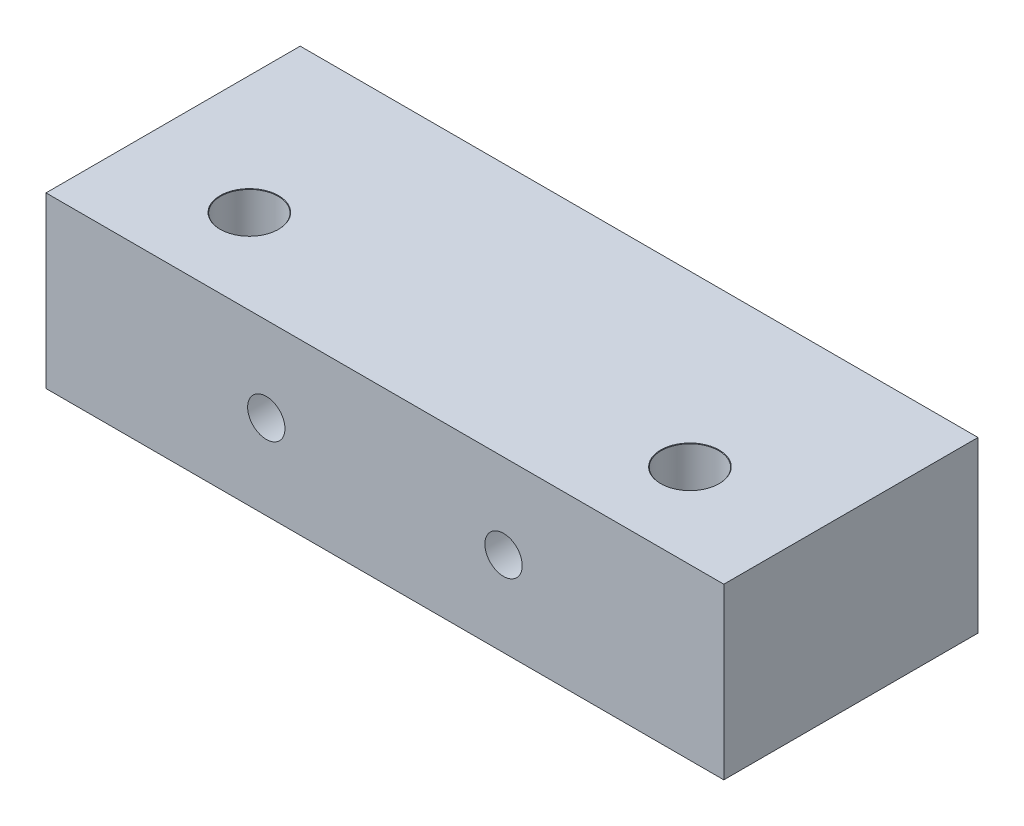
ISO-10303-21;
HEADER;
FILE_DESCRIPTION(('STEP AP214'),'2;1');
FILE_NAME('part.step','',(''),(''),'','','');
FILE_SCHEMA(('AUTOMOTIVE_DESIGN { 1 0 10303 214 1 1 1 1 }'));
ENDSEC;
DATA;
#1=APPLICATION_CONTEXT('core data for automotive mechanical design processes');
#2=APPLICATION_PROTOCOL_DEFINITION('international standard','automotive_design',2000,#1);
#3=PRODUCT_CONTEXT('',#1,'mechanical');
#4=PRODUCT('Part','Part','',(#3));
#5=PRODUCT_RELATED_PRODUCT_CATEGORY('part','',(#4));
#6=PRODUCT_DEFINITION_FORMATION('','',#4);
#7=PRODUCT_DEFINITION_CONTEXT('part definition',#1,'design');
#8=PRODUCT_DEFINITION('design','',#6,#7);
#9=PRODUCT_DEFINITION_SHAPE('','',#8);
#10=(LENGTH_UNIT() NAMED_UNIT(*) SI_UNIT(.MILLI.,.METRE.));
#11=(NAMED_UNIT(*) PLANE_ANGLE_UNIT() SI_UNIT($,.RADIAN.));
#12=(NAMED_UNIT(*) SI_UNIT($,.STERADIAN.) SOLID_ANGLE_UNIT());
#13=UNCERTAINTY_MEASURE_WITH_UNIT(LENGTH_MEASURE(1.E-05),#10,'distance_accuracy_value','');
#14=(GEOMETRIC_REPRESENTATION_CONTEXT(3) GLOBAL_UNCERTAINTY_ASSIGNED_CONTEXT((#13)) GLOBAL_UNIT_ASSIGNED_CONTEXT((#10,
#11,#12)) REPRESENTATION_CONTEXT('',''));
#15=CARTESIAN_POINT('',(0.,0.,0.));
#16=DIRECTION('',(0.,0.,1.));
#17=DIRECTION('',(1.,0.,0.));
#18=AXIS2_PLACEMENT_3D('',#15,#16,#17);
#19=CARTESIAN_POINT('',(69.3601743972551,-27.431998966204,15.));
#20=DIRECTION('',(-1.,0.,0.));
#21=DIRECTION('',(0.,0.,1.));
#22=AXIS2_PLACEMENT_3D('',#19,#20,#21);
#23=PLANE('',#22);
#24=DIRECTION('',(0.,1.,0.));
#25=VECTOR('',#24,1.);
#26=CARTESIAN_POINT('',(69.3601743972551,-27.431998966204,0.));
#27=LINE('',#26,#25);
#28=CARTESIAN_POINT('',(69.3601743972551,-37.431998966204,0.));
#29=VERTEX_POINT('',#28);
#30=CARTESIAN_POINT('',(69.3601743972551,-27.431998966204,0.));
#31=VERTEX_POINT('',#30);
#32=EDGE_CURVE('E82',#29,#31,#27,.T.);
#33=ORIENTED_EDGE('',*,*,#32,.T.);
#34=DIRECTION('',(0.,0.,-1.));
#35=VECTOR('',#34,1.);
#36=CARTESIAN_POINT('',(69.3601743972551,-27.431998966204,15.));
#37=LINE('',#36,#35);
#38=CARTESIAN_POINT('',(69.3601743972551,-27.431998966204,15.));
#39=VERTEX_POINT('',#38);
#40=EDGE_CURVE('E11',#39,#31,#37,.T.);
#41=ORIENTED_EDGE('',*,*,#40,.F.);
#42=DIRECTION('',(0.,1.,0.));
#43=VECTOR('',#42,1.);
#44=CARTESIAN_POINT('',(69.3601743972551,-27.431998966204,15.));
#45=LINE('',#44,#43);
#46=CARTESIAN_POINT('',(69.3601743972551,-37.431998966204,15.));
#47=VERTEX_POINT('',#46);
#48=EDGE_CURVE('E69',#47,#39,#45,.T.);
#49=ORIENTED_EDGE('',*,*,#48,.F.);
#50=DIRECTION('',(0.,0.,-1.));
#51=VECTOR('',#50,1.);
#52=CARTESIAN_POINT('',(69.3601743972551,-37.431998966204,15.));
#53=LINE('',#52,#51);
#54=EDGE_CURVE('E78',#47,#29,#53,.T.);
#55=ORIENTED_EDGE('',*,*,#54,.T.);
#56=EDGE_LOOP('',(#33,#41,#49,#55));
#57=FACE_BOUND('',#56,.T.);
#58=ADVANCED_FACE('F16',(#57),#23,.F.);
#59=CARTESIAN_POINT('',(69.3601743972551,-27.431998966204,15.));
#60=DIRECTION('',(0.,-1.,0.));
#61=DIRECTION('',(1.,0.,0.));
#62=AXIS2_PLACEMENT_3D('',#59,#60,#61);
#63=PLANE('',#62);
#64=CARTESIAN_POINT('',(62.3601743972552,-27.431998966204,10.));
#65=DIRECTION('',(0.,-1.,0.));
#66=DIRECTION('',(0.,0.,-1.));
#67=AXIS2_PLACEMENT_3D('',#64,#65,#66);
#68=CIRCLE('',#67,1.725);
#69=CARTESIAN_POINT('',(62.3601743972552,-27.431998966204,8.275));
#70=VERTEX_POINT('',#69);
#71=EDGE_CURVE('E147',#70,#70,#68,.T.);
#72=ORIENTED_EDGE('',*,*,#71,.T.);
#73=EDGE_LOOP('',(#72));
#74=FACE_BOUND('',#73,.T.);
#75=CARTESIAN_POINT('',(36.3601743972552,-27.431998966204,10.));
#76=DIRECTION('',(0.,-1.,0.));
#77=DIRECTION('',(0.,0.,-1.));
#78=AXIS2_PLACEMENT_3D('',#75,#76,#77);
#79=CIRCLE('',#78,1.725);
#80=CARTESIAN_POINT('',(36.3601743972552,-27.431998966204,8.275));
#81=VERTEX_POINT('',#80);
#82=EDGE_CURVE('E126',#81,#81,#79,.T.);
#83=ORIENTED_EDGE('',*,*,#82,.T.);
#84=EDGE_LOOP('',(#83));
#85=FACE_BOUND('',#84,.T.);
#86=DIRECTION('',(-1.,0.,0.));
#87=VECTOR('',#86,1.);
#88=CARTESIAN_POINT('',(69.3601743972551,-27.431998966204,0.));
#89=LINE('',#88,#87);
#90=CARTESIAN_POINT('',(29.3601743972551,-27.431998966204,0.));
#91=VERTEX_POINT('',#90);
#92=EDGE_CURVE('E73',#31,#91,#89,.T.);
#93=ORIENTED_EDGE('',*,*,#92,.T.);
#94=DIRECTION('',(0.,0.,-1.));
#95=VECTOR('',#94,1.);
#96=CARTESIAN_POINT('',(29.3601743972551,-27.431998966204,15.));
#97=LINE('',#96,#95);
#98=CARTESIAN_POINT('',(29.3601743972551,-27.431998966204,15.));
#99=VERTEX_POINT('',#98);
#100=EDGE_CURVE('E25',#99,#91,#97,.T.);
#101=ORIENTED_EDGE('',*,*,#100,.F.);
#102=DIRECTION('',(-1.,0.,0.));
#103=VECTOR('',#102,1.);
#104=CARTESIAN_POINT('',(69.3601743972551,-27.431998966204,15.));
#105=LINE('',#104,#103);
#106=EDGE_CURVE('E64',#39,#99,#105,.T.);
#107=ORIENTED_EDGE('',*,*,#106,.F.);
#108=ORIENTED_EDGE('',*,*,#40,.T.);
#109=EDGE_LOOP('',(#93,#101,#107,#108));
#110=FACE_BOUND('',#109,.T.);
#111=ADVANCED_FACE('F72',(#74,#85,#110),#63,.F.);
#112=CARTESIAN_POINT('',(29.3601743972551,-27.431998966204,15.));
#113=DIRECTION('',(1.,0.,0.));
#114=DIRECTION('',(0.,0.,-1.));
#115=AXIS2_PLACEMENT_3D('',#112,#113,#114);
#116=PLANE('',#115);
#117=DIRECTION('',(0.,-1.,0.));
#118=VECTOR('',#117,1.);
#119=CARTESIAN_POINT('',(29.3601743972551,-27.431998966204,0.));
#120=LINE('',#119,#118);
#121=CARTESIAN_POINT('',(29.3601743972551,-37.431998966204,0.));
#122=VERTEX_POINT('',#121);
#123=EDGE_CURVE('E51',#91,#122,#120,.T.);
#124=ORIENTED_EDGE('',*,*,#123,.T.);
#125=DIRECTION('',(0.,0.,-1.));
#126=VECTOR('',#125,1.);
#127=CARTESIAN_POINT('',(29.3601743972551,-37.431998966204,15.));
#128=LINE('',#127,#126);
#129=CARTESIAN_POINT('',(29.3601743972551,-37.431998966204,15.));
#130=VERTEX_POINT('',#129);
#131=EDGE_CURVE('E74',#130,#122,#128,.T.);
#132=ORIENTED_EDGE('',*,*,#131,.F.);
#133=DIRECTION('',(0.,-1.,0.));
#134=VECTOR('',#133,1.);
#135=CARTESIAN_POINT('',(29.3601743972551,-27.431998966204,15.));
#136=LINE('',#135,#134);
#137=EDGE_CURVE('E67',#99,#130,#136,.T.);
#138=ORIENTED_EDGE('',*,*,#137,.F.);
#139=ORIENTED_EDGE('',*,*,#100,.T.);
#140=EDGE_LOOP('',(#124,#132,#138,#139));
#141=FACE_BOUND('',#140,.T.);
#142=ADVANCED_FACE('F76',(#141),#116,.F.);
#143=CARTESIAN_POINT('',(69.3601743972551,-37.431998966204,15.));
#144=DIRECTION('',(0.,1.,0.));
#145=DIRECTION('',(-1.,0.,0.));
#146=AXIS2_PLACEMENT_3D('',#143,#144,#145);
#147=PLANE('',#146);
#148=CARTESIAN_POINT('',(62.3601743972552,-37.431998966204,10.));
#149=DIRECTION('',(0.,-1.,0.));
#150=DIRECTION('',(0.,0.,-1.));
#151=AXIS2_PLACEMENT_3D('',#148,#149,#150);
#152=CIRCLE('',#151,3.025);
#153=CARTESIAN_POINT('',(62.3601743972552,-37.431998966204,6.975));
#154=VERTEX_POINT('',#153);
#155=EDGE_CURVE('E144',#154,#154,#152,.T.);
#156=ORIENTED_EDGE('',*,*,#155,.F.);
#157=EDGE_LOOP('',(#156));
#158=FACE_BOUND('',#157,.T.);
#159=CARTESIAN_POINT('',(36.3601743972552,-37.431998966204,10.));
#160=DIRECTION('',(0.,-1.,0.));
#161=DIRECTION('',(0.,0.,-1.));
#162=AXIS2_PLACEMENT_3D('',#159,#160,#161);
#163=CIRCLE('',#162,3.025);
#164=CARTESIAN_POINT('',(36.3601743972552,-37.431998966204,6.975));
#165=VERTEX_POINT('',#164);
#166=EDGE_CURVE('E123',#165,#165,#163,.T.);
#167=ORIENTED_EDGE('',*,*,#166,.F.);
#168=EDGE_LOOP('',(#167));
#169=FACE_BOUND('',#168,.T.);
#170=DIRECTION('',(1.,0.,0.));
#171=VECTOR('',#170,1.);
#172=CARTESIAN_POINT('',(69.3601743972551,-37.431998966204,0.));
#173=LINE('',#172,#171);
#174=EDGE_CURVE('E57',#122,#29,#173,.T.);
#175=ORIENTED_EDGE('',*,*,#174,.T.);
#176=ORIENTED_EDGE('',*,*,#54,.F.);
#177=DIRECTION('',(1.,0.,0.));
#178=VECTOR('',#177,1.);
#179=CARTESIAN_POINT('',(69.3601743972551,-37.431998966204,15.));
#180=LINE('',#179,#178);
#181=EDGE_CURVE('E34',#130,#47,#180,.T.);
#182=ORIENTED_EDGE('',*,*,#181,.F.);
#183=ORIENTED_EDGE('',*,*,#131,.T.);
#184=EDGE_LOOP('',(#175,#176,#182,#183));
#185=FACE_BOUND('',#184,.T.);
#186=ADVANCED_FACE('F190',(#158,#169,#185),#147,.F.);
#187=CARTESIAN_POINT('',(0.,0.,15.));
#188=DIRECTION('',(0.,0.,-1.));
#189=DIRECTION('',(-1.,0.,0.));
#190=AXIS2_PLACEMENT_3D('',#187,#188,#189);
#191=PLANE('',#190);
#192=CARTESIAN_POINT('',(42.3601743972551,-32.431998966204,15.));
#193=DIRECTION('',(0.,0.,-1.));
#194=DIRECTION('',(-1.,0.,0.));
#195=AXIS2_PLACEMENT_3D('',#192,#193,#194);
#196=CIRCLE('',#195,1.10143231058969);
#197=CARTESIAN_POINT('',(41.2587420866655,-32.431998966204,15.));
#198=VERTEX_POINT('',#197);
#199=EDGE_CURVE('E19',#198,#198,#196,.T.);
#200=ORIENTED_EDGE('',*,*,#199,.T.);
#201=EDGE_LOOP('',(#200));
#202=FACE_BOUND('',#201,.T.);
#203=CARTESIAN_POINT('',(56.3601743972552,-32.431998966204,15.));
#204=DIRECTION('',(0.,0.,-1.));
#205=DIRECTION('',(-1.,0.,0.));
#206=AXIS2_PLACEMENT_3D('',#203,#204,#205);
#207=CIRCLE('',#206,1.10143231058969);
#208=CARTESIAN_POINT('',(55.2587420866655,-32.431998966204,15.));
#209=VERTEX_POINT('',#208);
#210=EDGE_CURVE('E85',#209,#209,#207,.T.);
#211=ORIENTED_EDGE('',*,*,#210,.T.);
#212=EDGE_LOOP('',(#211));
#213=FACE_BOUND('',#212,.T.);
#214=ORIENTED_EDGE('',*,*,#48,.T.);
#215=ORIENTED_EDGE('',*,*,#106,.T.);
#216=ORIENTED_EDGE('',*,*,#137,.T.);
#217=ORIENTED_EDGE('',*,*,#181,.T.);
#218=EDGE_LOOP('',(#214,#215,#216,#217));
#219=FACE_BOUND('',#218,.T.);
#220=ADVANCED_FACE('F65',(#202,#213,#219),#191,.F.);
#221=CARTESIAN_POINT('',(0.,0.,0.));
#222=DIRECTION('',(0.,0.,-1.));
#223=DIRECTION('',(-1.,0.,0.));
#224=AXIS2_PLACEMENT_3D('',#221,#222,#223);
#225=PLANE('',#224);
#226=CARTESIAN_POINT('',(42.3601743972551,-32.431998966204,0.));
#227=DIRECTION('',(0.,0.,-1.));
#228=DIRECTION('',(-1.,0.,0.));
#229=AXIS2_PLACEMENT_3D('',#226,#227,#228);
#230=CIRCLE('',#229,2.1);
#231=CARTESIAN_POINT('',(40.2601743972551,-32.431998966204,0.));
#232=VERTEX_POINT('',#231);
#233=EDGE_CURVE('E105',#232,#232,#230,.T.);
#234=ORIENTED_EDGE('',*,*,#233,.F.);
#235=EDGE_LOOP('',(#234));
#236=FACE_BOUND('',#235,.T.);
#237=CARTESIAN_POINT('',(56.3601743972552,-32.431998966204,0.));
#238=DIRECTION('',(0.,0.,-1.));
#239=DIRECTION('',(-1.,0.,0.));
#240=AXIS2_PLACEMENT_3D('',#237,#238,#239);
#241=CIRCLE('',#240,2.1);
#242=CARTESIAN_POINT('',(54.2601743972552,-32.431998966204,0.));
#243=VERTEX_POINT('',#242);
#244=EDGE_CURVE('E95',#243,#243,#241,.T.);
#245=ORIENTED_EDGE('',*,*,#244,.F.);
#246=EDGE_LOOP('',(#245));
#247=FACE_BOUND('',#246,.T.);
#248=ORIENTED_EDGE('',*,*,#32,.F.);
#249=ORIENTED_EDGE('',*,*,#174,.F.);
#250=ORIENTED_EDGE('',*,*,#123,.F.);
#251=ORIENTED_EDGE('',*,*,#92,.F.);
#252=EDGE_LOOP('',(#248,#249,#250,#251));
#253=FACE_BOUND('',#252,.T.);
#254=ADVANCED_FACE('F217',(#236,#247,#253),#225,.T.);
#255=CARTESIAN_POINT('',(56.3601743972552,-32.431998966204,14.4));
#256=DIRECTION('',(0.,0.,-1.));
#257=DIRECTION('',(-1.,0.,0.));
#258=AXIS2_PLACEMENT_3D('',#255,#256,#257);
#259=CONICAL_SURFACE('',#258,2.1,1.02974425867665);
#260=CARTESIAN_POINT('',(56.3601743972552,-32.431998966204,14.4));
#261=DIRECTION('',(0.,0.,-1.));
#262=DIRECTION('',(-1.,0.,0.));
#263=AXIS2_PLACEMENT_3D('',#260,#261,#262);
#264=CIRCLE('',#263,2.1);
#265=CARTESIAN_POINT('',(54.2601743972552,-32.431998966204,14.4));
#266=VERTEX_POINT('',#265);
#267=EDGE_CURVE('E91',#266,#266,#264,.T.);
#268=ORIENTED_EDGE('',*,*,#267,.T.);
#269=EDGE_LOOP('',(#268));
#270=FACE_BOUND('',#269,.T.);
#271=ORIENTED_EDGE('',*,*,#210,.F.);
#272=EDGE_LOOP('',(#271));
#273=FACE_BOUND('',#272,.T.);
#274=ADVANCED_FACE('F219',(#270,#273),#259,.F.);
#275=CARTESIAN_POINT('',(56.3601743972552,-32.431998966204,0.));
#276=DIRECTION('',(0.,0.,-1.));
#277=DIRECTION('',(-1.,0.,0.));
#278=AXIS2_PLACEMENT_3D('',#275,#276,#277);
#279=CYLINDRICAL_SURFACE('',#278,2.1);
#280=ORIENTED_EDGE('',*,*,#267,.F.);
#281=EDGE_LOOP('',(#280));
#282=FACE_BOUND('',#281,.T.);
#283=ORIENTED_EDGE('',*,*,#244,.T.);
#284=EDGE_LOOP('',(#283));
#285=FACE_BOUND('',#284,.T.);
#286=ADVANCED_FACE('F227',(#282,#285),#279,.F.);
#287=CARTESIAN_POINT('',(42.3601743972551,-32.431998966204,14.4));
#288=DIRECTION('',(0.,0.,-1.));
#289=DIRECTION('',(-1.,0.,0.));
#290=AXIS2_PLACEMENT_3D('',#287,#288,#289);
#291=CONICAL_SURFACE('',#290,2.1,1.02974425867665);
#292=CARTESIAN_POINT('',(42.3601743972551,-32.431998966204,14.4));
#293=DIRECTION('',(0.,0.,-1.));
#294=DIRECTION('',(-1.,0.,0.));
#295=AXIS2_PLACEMENT_3D('',#292,#293,#294);
#296=CIRCLE('',#295,2.1);
#297=CARTESIAN_POINT('',(40.2601743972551,-32.431998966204,14.4));
#298=VERTEX_POINT('',#297);
#299=EDGE_CURVE('E102',#298,#298,#296,.T.);
#300=ORIENTED_EDGE('',*,*,#299,.T.);
#301=EDGE_LOOP('',(#300));
#302=FACE_BOUND('',#301,.T.);
#303=ORIENTED_EDGE('',*,*,#199,.F.);
#304=EDGE_LOOP('',(#303));
#305=FACE_BOUND('',#304,.T.);
#306=ADVANCED_FACE('F274',(#302,#305),#291,.F.);
#307=CARTESIAN_POINT('',(42.3601743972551,-32.431998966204,0.));
#308=DIRECTION('',(0.,0.,-1.));
#309=DIRECTION('',(-1.,0.,0.));
#310=AXIS2_PLACEMENT_3D('',#307,#308,#309);
#311=CYLINDRICAL_SURFACE('',#310,2.1);
#312=ORIENTED_EDGE('',*,*,#299,.F.);
#313=EDGE_LOOP('',(#312));
#314=FACE_BOUND('',#313,.T.);
#315=ORIENTED_EDGE('',*,*,#233,.T.);
#316=EDGE_LOOP('',(#315));
#317=FACE_BOUND('',#316,.T.);
#318=ADVANCED_FACE('F286',(#314,#317),#311,.F.);
#319=CARTESIAN_POINT('',(36.3601743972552,-27.456998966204,10.));
#320=DIRECTION('',(0.,1.,0.));
#321=DIRECTION('',(0.,0.,1.));
#322=AXIS2_PLACEMENT_3D('',#319,#320,#321);
#323=CONICAL_SURFACE('',#322,1.7,0.785398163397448);
#324=ORIENTED_EDGE('',*,*,#82,.F.);
#325=EDGE_LOOP('',(#324));
#326=FACE_BOUND('',#325,.T.);
#327=CARTESIAN_POINT('',(36.3601743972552,-27.456998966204,10.));
#328=DIRECTION('',(0.,-1.,0.));
#329=DIRECTION('',(0.,0.,-1.));
#330=AXIS2_PLACEMENT_3D('',#327,#328,#329);
#331=CIRCLE('',#330,1.7);
#332=CARTESIAN_POINT('',(36.3601743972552,-27.456998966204,8.3));
#333=VERTEX_POINT('',#332);
#334=EDGE_CURVE('E108',#333,#333,#331,.T.);
#335=ORIENTED_EDGE('',*,*,#334,.T.);
#336=EDGE_LOOP('',(#335));
#337=FACE_BOUND('',#336,.T.);
#338=ADVANCED_FACE('F295',(#326,#337),#323,.F.);
#339=CARTESIAN_POINT('',(36.3601743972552,-37.431998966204,10.));
#340=DIRECTION('',(0.,-1.,0.));
#341=DIRECTION('',(0.,0.,-1.));
#342=AXIS2_PLACEMENT_3D('',#339,#340,#341);
#343=CYLINDRICAL_SURFACE('',#342,1.7);
#344=ORIENTED_EDGE('',*,*,#334,.F.);
#345=EDGE_LOOP('',(#344));
#346=FACE_BOUND('',#345,.T.);
#347=CARTESIAN_POINT('',(36.3601743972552,-34.006998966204,10.));
#348=DIRECTION('',(0.,-1.,0.));
#349=DIRECTION('',(0.,0.,-1.));
#350=AXIS2_PLACEMENT_3D('',#347,#348,#349);
#351=CIRCLE('',#350,1.7);
#352=CARTESIAN_POINT('',(36.3601743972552,-34.006998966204,8.3));
#353=VERTEX_POINT('',#352);
#354=EDGE_CURVE('E111',#353,#353,#351,.T.);
#355=ORIENTED_EDGE('',*,*,#354,.T.);
#356=EDGE_LOOP('',(#355));
#357=FACE_BOUND('',#356,.T.);
#358=ADVANCED_FACE('F305',(#346,#357),#343,.F.);
#359=CARTESIAN_POINT('',(36.3601743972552,-34.031998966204,10.));
#360=DIRECTION('',(0.,-1.,0.));
#361=DIRECTION('',(0.,0.,-1.));
#362=AXIS2_PLACEMENT_3D('',#359,#360,#361);
#363=CONICAL_SURFACE('',#362,1.725,0.785398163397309);
#364=ORIENTED_EDGE('',*,*,#354,.F.);
#365=EDGE_LOOP('',(#364));
#366=FACE_BOUND('',#365,.T.);
#367=CARTESIAN_POINT('',(36.3601743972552,-34.031998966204,10.));
#368=DIRECTION('',(0.,-1.,0.));
#369=DIRECTION('',(0.,0.,-1.));
#370=AXIS2_PLACEMENT_3D('',#367,#368,#369);
#371=CIRCLE('',#370,1.725);
#372=CARTESIAN_POINT('',(36.3601743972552,-34.031998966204,8.275));
#373=VERTEX_POINT('',#372);
#374=EDGE_CURVE('E114',#373,#373,#371,.T.);
#375=ORIENTED_EDGE('',*,*,#374,.T.);
#376=EDGE_LOOP('',(#375));
#377=FACE_BOUND('',#376,.T.);
#378=ADVANCED_FACE('F315',(#366,#377),#363,.F.);
#379=CARTESIAN_POINT('',(38.0851743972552,-34.031998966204,10.));
#380=DIRECTION('',(0.,1.,0.));
#381=DIRECTION('',(0.,0.,1.));
#382=AXIS2_PLACEMENT_3D('',#379,#380,#381);
#383=PLANE('',#382);
#384=ORIENTED_EDGE('',*,*,#374,.F.);
#385=EDGE_LOOP('',(#384));
#386=FACE_BOUND('',#385,.T.);
#387=CARTESIAN_POINT('',(36.3601743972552,-34.031998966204,10.));
#388=DIRECTION('',(0.,-1.,0.));
#389=DIRECTION('',(0.,0.,-1.));
#390=AXIS2_PLACEMENT_3D('',#387,#388,#389);
#391=CIRCLE('',#390,3.);
#392=CARTESIAN_POINT('',(36.3601743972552,-34.031998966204,7.));
#393=VERTEX_POINT('',#392);
#394=EDGE_CURVE('E117',#393,#393,#391,.T.);
#395=ORIENTED_EDGE('',*,*,#394,.T.);
#396=EDGE_LOOP('',(#395));
#397=FACE_BOUND('',#396,.T.);
#398=ADVANCED_FACE('F205',(#386,#397),#383,.F.);
#399=CARTESIAN_POINT('',(36.3601743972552,-37.431998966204,10.));
#400=DIRECTION('',(0.,-1.,0.));
#401=DIRECTION('',(0.,0.,-1.));
#402=AXIS2_PLACEMENT_3D('',#399,#400,#401);
#403=CYLINDRICAL_SURFACE('',#402,3.);
#404=ORIENTED_EDGE('',*,*,#394,.F.);
#405=EDGE_LOOP('',(#404));
#406=FACE_BOUND('',#405,.T.);
#407=CARTESIAN_POINT('',(36.3601743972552,-37.406998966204,10.));
#408=DIRECTION('',(0.,-1.,0.));
#409=DIRECTION('',(0.,0.,-1.));
#410=AXIS2_PLACEMENT_3D('',#407,#408,#409);
#411=CIRCLE('',#410,3.);
#412=CARTESIAN_POINT('',(36.3601743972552,-37.406998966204,7.));
#413=VERTEX_POINT('',#412);
#414=EDGE_CURVE('E120',#413,#413,#411,.T.);
#415=ORIENTED_EDGE('',*,*,#414,.T.);
#416=EDGE_LOOP('',(#415));
#417=FACE_BOUND('',#416,.T.);
#418=ADVANCED_FACE('F197',(#406,#417),#403,.F.);
#419=CARTESIAN_POINT('',(36.3601743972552,-37.431998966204,10.));
#420=DIRECTION('',(0.,-1.,0.));
#421=DIRECTION('',(0.,0.,-1.));
#422=AXIS2_PLACEMENT_3D('',#419,#420,#421);
#423=CONICAL_SURFACE('',#422,3.025,0.785398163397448);
#424=ORIENTED_EDGE('',*,*,#414,.F.);
#425=EDGE_LOOP('',(#424));
#426=FACE_BOUND('',#425,.T.);
#427=ORIENTED_EDGE('',*,*,#166,.T.);
#428=EDGE_LOOP('',(#427));
#429=FACE_BOUND('',#428,.T.);
#430=ADVANCED_FACE('F157',(#426,#429),#423,.F.);
#431=CARTESIAN_POINT('',(62.3601743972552,-27.456998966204,10.));
#432=DIRECTION('',(0.,1.,0.));
#433=DIRECTION('',(0.,0.,1.));
#434=AXIS2_PLACEMENT_3D('',#431,#432,#433);
#435=CONICAL_SURFACE('',#434,1.7,0.785398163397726);
#436=ORIENTED_EDGE('',*,*,#71,.F.);
#437=EDGE_LOOP('',(#436));
#438=FACE_BOUND('',#437,.T.);
#439=CARTESIAN_POINT('',(62.3601743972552,-27.456998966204,10.));
#440=DIRECTION('',(0.,-1.,0.));
#441=DIRECTION('',(0.,0.,-1.));
#442=AXIS2_PLACEMENT_3D('',#439,#440,#441);
#443=CIRCLE('',#442,1.7);
#444=CARTESIAN_POINT('',(62.3601743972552,-27.456998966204,8.3));
#445=VERTEX_POINT('',#444);
#446=EDGE_CURVE('E129',#445,#445,#443,.T.);
#447=ORIENTED_EDGE('',*,*,#446,.T.);
#448=EDGE_LOOP('',(#447));
#449=FACE_BOUND('',#448,.T.);
#450=ADVANCED_FACE('F153',(#438,#449),#435,.F.);
#451=CARTESIAN_POINT('',(62.3601743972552,-37.431998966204,10.));
#452=DIRECTION('',(0.,-1.,0.));
#453=DIRECTION('',(0.,0.,-1.));
#454=AXIS2_PLACEMENT_3D('',#451,#452,#453);
#455=CYLINDRICAL_SURFACE('',#454,1.7);
#456=ORIENTED_EDGE('',*,*,#446,.F.);
#457=EDGE_LOOP('',(#456));
#458=FACE_BOUND('',#457,.T.);
#459=CARTESIAN_POINT('',(62.3601743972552,-34.006998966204,10.));
#460=DIRECTION('',(0.,-1.,0.));
#461=DIRECTION('',(0.,0.,-1.));
#462=AXIS2_PLACEMENT_3D('',#459,#460,#461);
#463=CIRCLE('',#462,1.7);
#464=CARTESIAN_POINT('',(62.3601743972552,-34.006998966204,8.3));
#465=VERTEX_POINT('',#464);
#466=EDGE_CURVE('E132',#465,#465,#463,.T.);
#467=ORIENTED_EDGE('',*,*,#466,.T.);
#468=EDGE_LOOP('',(#467));
#469=FACE_BOUND('',#468,.T.);
#470=ADVANCED_FACE('F156',(#458,#469),#455,.F.);
#471=CARTESIAN_POINT('',(62.3601743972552,-34.031998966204,10.));
#472=DIRECTION('',(0.,-1.,0.));
#473=DIRECTION('',(0.,0.,-1.));
#474=AXIS2_PLACEMENT_3D('',#471,#472,#473);
#475=CONICAL_SURFACE('',#474,1.725,0.785398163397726);
#476=ORIENTED_EDGE('',*,*,#466,.F.);
#477=EDGE_LOOP('',(#476));
#478=FACE_BOUND('',#477,.T.);
#479=CARTESIAN_POINT('',(62.3601743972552,-34.031998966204,10.));
#480=DIRECTION('',(0.,-1.,0.));
#481=DIRECTION('',(0.,0.,-1.));
#482=AXIS2_PLACEMENT_3D('',#479,#480,#481);
#483=CIRCLE('',#482,1.725);
#484=CARTESIAN_POINT('',(62.3601743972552,-34.031998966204,8.275));
#485=VERTEX_POINT('',#484);
#486=EDGE_CURVE('E135',#485,#485,#483,.T.);
#487=ORIENTED_EDGE('',*,*,#486,.T.);
#488=EDGE_LOOP('',(#487));
#489=FACE_BOUND('',#488,.T.);
#490=ADVANCED_FACE('F163',(#478,#489),#475,.F.);
#491=CARTESIAN_POINT('',(64.0851743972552,-34.031998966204,10.));
#492=DIRECTION('',(0.,1.,0.));
#493=DIRECTION('',(0.,0.,1.));
#494=AXIS2_PLACEMENT_3D('',#491,#492,#493);
#495=PLANE('',#494);
#496=ORIENTED_EDGE('',*,*,#486,.F.);
#497=EDGE_LOOP('',(#496));
#498=FACE_BOUND('',#497,.T.);
#499=CARTESIAN_POINT('',(62.3601743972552,-34.031998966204,10.));
#500=DIRECTION('',(0.,-1.,0.));
#501=DIRECTION('',(0.,0.,-1.));
#502=AXIS2_PLACEMENT_3D('',#499,#500,#501);
#503=CIRCLE('',#502,3.);
#504=CARTESIAN_POINT('',(62.3601743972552,-34.031998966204,7.));
#505=VERTEX_POINT('',#504);
#506=EDGE_CURVE('E138',#505,#505,#503,.T.);
#507=ORIENTED_EDGE('',*,*,#506,.T.);
#508=EDGE_LOOP('',(#507));
#509=FACE_BOUND('',#508,.T.);
#510=ADVANCED_FACE('F169',(#498,#509),#495,.F.);
#511=CARTESIAN_POINT('',(62.3601743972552,-37.431998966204,10.));
#512=DIRECTION('',(0.,-1.,0.));
#513=DIRECTION('',(0.,0.,-1.));
#514=AXIS2_PLACEMENT_3D('',#511,#512,#513);
#515=CYLINDRICAL_SURFACE('',#514,3.);
#516=ORIENTED_EDGE('',*,*,#506,.F.);
#517=EDGE_LOOP('',(#516));
#518=FACE_BOUND('',#517,.T.);
#519=CARTESIAN_POINT('',(62.3601743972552,-37.406998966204,10.));
#520=DIRECTION('',(0.,-1.,0.));
#521=DIRECTION('',(0.,0.,-1.));
#522=AXIS2_PLACEMENT_3D('',#519,#520,#521);
#523=CIRCLE('',#522,3.);
#524=CARTESIAN_POINT('',(62.3601743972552,-37.406998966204,7.));
#525=VERTEX_POINT('',#524);
#526=EDGE_CURVE('E141',#525,#525,#523,.T.);
#527=ORIENTED_EDGE('',*,*,#526,.T.);
#528=EDGE_LOOP('',(#527));
#529=FACE_BOUND('',#528,.T.);
#530=ADVANCED_FACE('F175',(#518,#529),#515,.F.);
#531=CARTESIAN_POINT('',(62.3601743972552,-37.431998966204,10.));
#532=DIRECTION('',(0.,-1.,0.));
#533=DIRECTION('',(0.,0.,-1.));
#534=AXIS2_PLACEMENT_3D('',#531,#532,#533);
#535=CONICAL_SURFACE('',#534,3.025,0.785398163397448);
#536=ORIENTED_EDGE('',*,*,#526,.F.);
#537=EDGE_LOOP('',(#536));
#538=FACE_BOUND('',#537,.T.);
#539=ORIENTED_EDGE('',*,*,#155,.T.);
#540=EDGE_LOOP('',(#539));
#541=FACE_BOUND('',#540,.T.);
#542=ADVANCED_FACE('F181',(#538,#541),#535,.F.);
#543=CLOSED_SHELL('',(#58,#111,#142,#186,#220,#254,#274,#286,#306,#318,#338,#358,#378,#398,#418,
#430,#450,#470,#490,#510,#530,#542));
#544=MANIFOLD_SOLID_BREP('B1',#543);
#545=ADVANCED_BREP_SHAPE_REPRESENTATION('',(#18,#544),#14);
#546=SHAPE_DEFINITION_REPRESENTATION(#9,#545);
ENDSEC;
END-ISO-10303-21;
